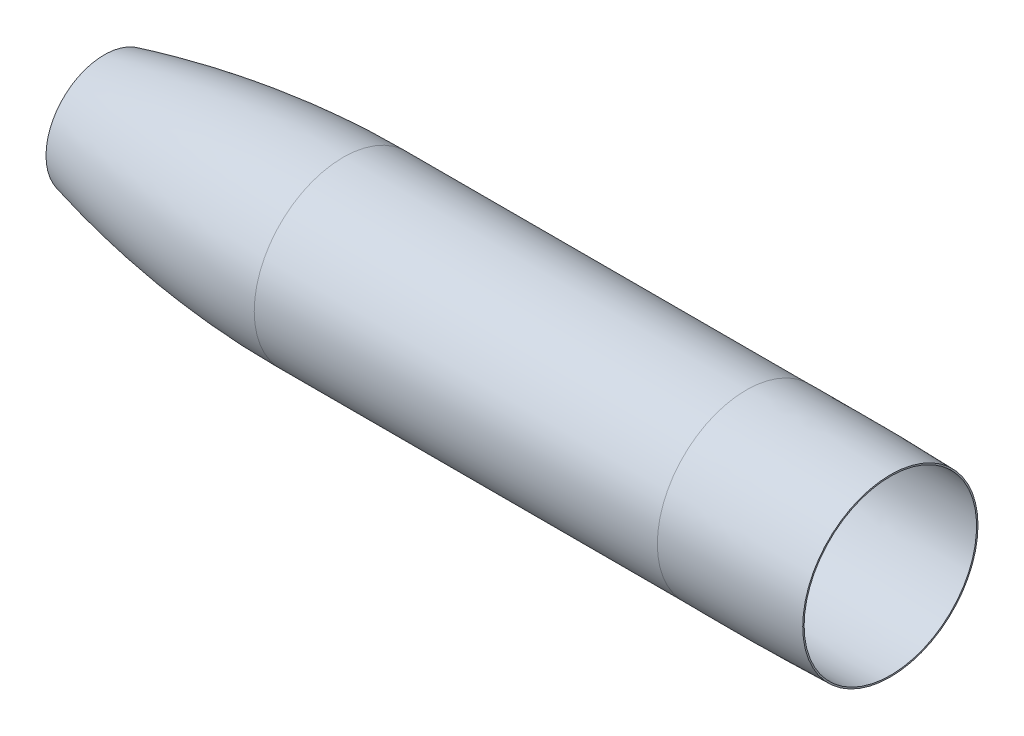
from build123d import *


with BuildPart() as part:
    # Sketch1 → Revolve1 (revolve)
    with BuildSketch(Plane.XY, mode=Mode.PRIVATE) as revolve1_sk:
        with BuildLine():
            Line((762, 265.376558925), (762, 258.820798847))
            Line((762, 258.820798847), (763.578421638, 259.225860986))
            add(Edge.make_bspline(
                [(1850.39, 398.78), (1838.857053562, 398.78), (1815.783486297, 398.684814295), (1769.700096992, 398.115325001), (1712.174302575, 396.695663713), (1643.288541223, 393.869337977), (1551.63790534, 388.61691812), (1437.461819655, 379.293292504), (1301.118679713, 363.769834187), (1165.494461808, 343.989409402), (1030.635333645, 320.029014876), (896.603973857, 291.969847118), (807.80257923, 270.574876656), (763.578421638, 259.225860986)],
                knots=[0, 0, 0, 0, 0.018029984, 0.036059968, 0.072119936, 0.108179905, 0.144239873, 0.216359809, 0.288479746, 0.360599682, 0.432719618, 0.504839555, 0.576959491, 0.576959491, 0.576959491, 0.576959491], degree=3))
            Line((1850.39, 398.78), (3686.81, 398.78))
            add(Edge.make_bspline(
                [(4343.170258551, 392.924651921), (4315.531564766, 393.925268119), (4260.222633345, 395.610131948), (4149.736279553, 397.90140794), (4039.57185631, 398.865107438), (3930.093280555, 399.077687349), (3862.026616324, 399.017899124), (3807.832482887, 398.926644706), (3767.326254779, 398.854544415), (3733.700368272, 398.806455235), (3706.873737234, 398.784209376), (3693.501320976, 398.78), (3686.81, 398.78)],
                knots=[0.518107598, 0.518107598, 0.518107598, 0.518107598, 0.578344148, 0.638580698, 0.759053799, 0.819290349, 0.879526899, 0.909645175, 0.93976345, 0.969881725, 0.984940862, 1, 1, 1, 1], degree=3))
            Line((4343.170258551, 392.924651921), (4343.4, 392.916330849))
            Line((4343.4, 392.916330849), (4343.399999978, 399.270494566))
            add(Edge.make_bspline(
                [(4343.399999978, 399.270494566), (4122.032153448, 407.284775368), (3900.660942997, 405.13), (3686.81, 405.13)],
                knots=[0.518107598, 0.518107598, 0.518107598, 0.518107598, 1, 1, 1, 1], degree=3))
            Line((3686.81, 405.13), (1850.39, 405.13))
            add(Edge.make_bspline(
                [(1850.39, 405.13), (1480.605415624, 405.13), (1116.38743289, 356.321163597), (762, 265.376558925)],
                knots=[0, 0, 0, 0, 0.576959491, 0.576959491, 0.576959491, 0.576959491], degree=3))
        make_face()
    revolve(revolve1_sk.sketch.rotate(Axis((0, 0, 0), (1, 0, 0)), 90), axis=Axis((0, 0, 0), (1, 0, 0)))


solid = part.part
